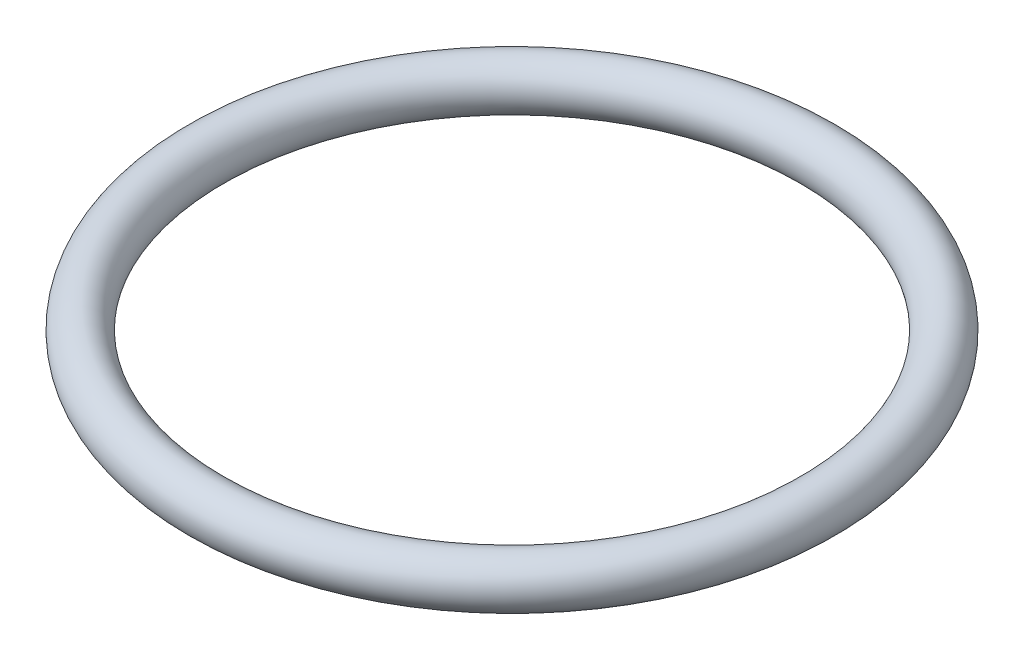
ISO-10303-21;
HEADER;
FILE_DESCRIPTION(('STEP AP214'),'2;1');
FILE_NAME('part.step','',(''),(''),'','','');
FILE_SCHEMA(('AUTOMOTIVE_DESIGN { 1 0 10303 214 1 1 1 1 }'));
ENDSEC;
DATA;
#1=APPLICATION_CONTEXT('core data for automotive mechanical design processes');
#2=APPLICATION_PROTOCOL_DEFINITION('international standard','automotive_design',2000,#1);
#3=PRODUCT_CONTEXT('',#1,'mechanical');
#4=PRODUCT('Part','Part','',(#3));
#5=PRODUCT_RELATED_PRODUCT_CATEGORY('part','',(#4));
#6=PRODUCT_DEFINITION_FORMATION('','',#4);
#7=PRODUCT_DEFINITION_CONTEXT('part definition',#1,'design');
#8=PRODUCT_DEFINITION('design','',#6,#7);
#9=PRODUCT_DEFINITION_SHAPE('','',#8);
#10=(LENGTH_UNIT() NAMED_UNIT(*) SI_UNIT(.MILLI.,.METRE.));
#11=(NAMED_UNIT(*) PLANE_ANGLE_UNIT() SI_UNIT($,.RADIAN.));
#12=(NAMED_UNIT(*) SI_UNIT($,.STERADIAN.) SOLID_ANGLE_UNIT());
#13=UNCERTAINTY_MEASURE_WITH_UNIT(LENGTH_MEASURE(1.E-05),#10,'distance_accuracy_value','');
#14=(GEOMETRIC_REPRESENTATION_CONTEXT(3) GLOBAL_UNCERTAINTY_ASSIGNED_CONTEXT((#13)) GLOBAL_UNIT_ASSIGNED_CONTEXT((#10,
#11,#12)) REPRESENTATION_CONTEXT('',''));
#15=CARTESIAN_POINT('',(0.,0.,0.));
#16=DIRECTION('',(0.,0.,1.));
#17=DIRECTION('',(1.,0.,0.));
#18=AXIS2_PLACEMENT_3D('',#15,#16,#17);
#19=CARTESIAN_POINT('',(0.,-0.4953,0.));
#20=DIRECTION('',(0.,1.,0.));
#21=DIRECTION('',(0.,0.,1.));
#22=AXIS2_PLACEMENT_3D('',#19,#20,#21);
#23=TOROIDAL_SURFACE('',#22,6.2484,0.495300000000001);
#24=CARTESIAN_POINT('',(0.,-0.4953,6.7437));
#25=VERTEX_POINT('',#24);
#26=VERTEX_LOOP('',#25);
#27=FACE_BOUND('',#26,.T.);
#28=ADVANCED_FACE('F25',(#27),#23,.T.);
#29=CLOSED_SHELL('',(#28));
#30=MANIFOLD_SOLID_BREP('B2',#29);
#31=ADVANCED_BREP_SHAPE_REPRESENTATION('',(#18,#30),#14);
#32=SHAPE_DEFINITION_REPRESENTATION(#9,#31);
ENDSEC;
END-ISO-10303-21;
